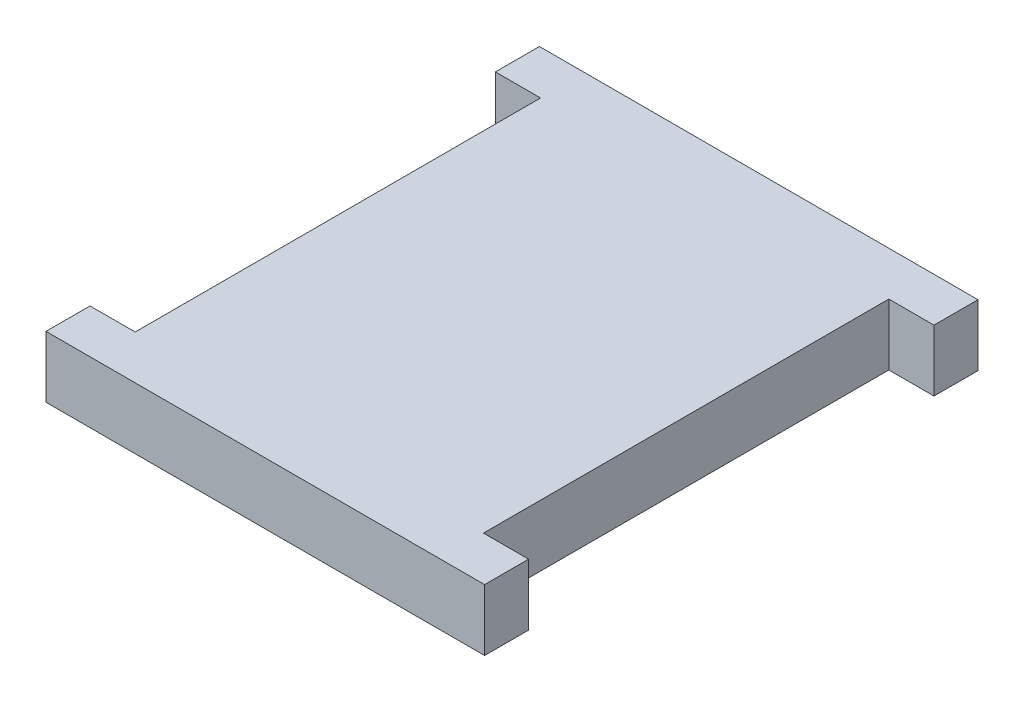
from build123d import *

# Parameters (mm, degrees)
BOSS_EXTRUDE1_DEPTH = 9.525


with BuildPart() as part:
    # Sketch1 → Boss-Extrude1 (new, symmetric)
    with BuildSketch(Plane(origin=(0, 0, 0), x_dir=(1, 0, 0), z_dir=(0, 1, 0))):
        Polygon((-68, 62.85), (-54, 62.85), (-54, -62.85), (-68, -62.85), (-68, -76.5), (68, -76.5), (68, -62.85), (54, -62.85), (54, 62.85), (68, 62.85), (68, 76.5), (-68, 76.5), align=None)
    extrude(amount=BOSS_EXTRUDE1_DEPTH, both=True)


solid = part.part
